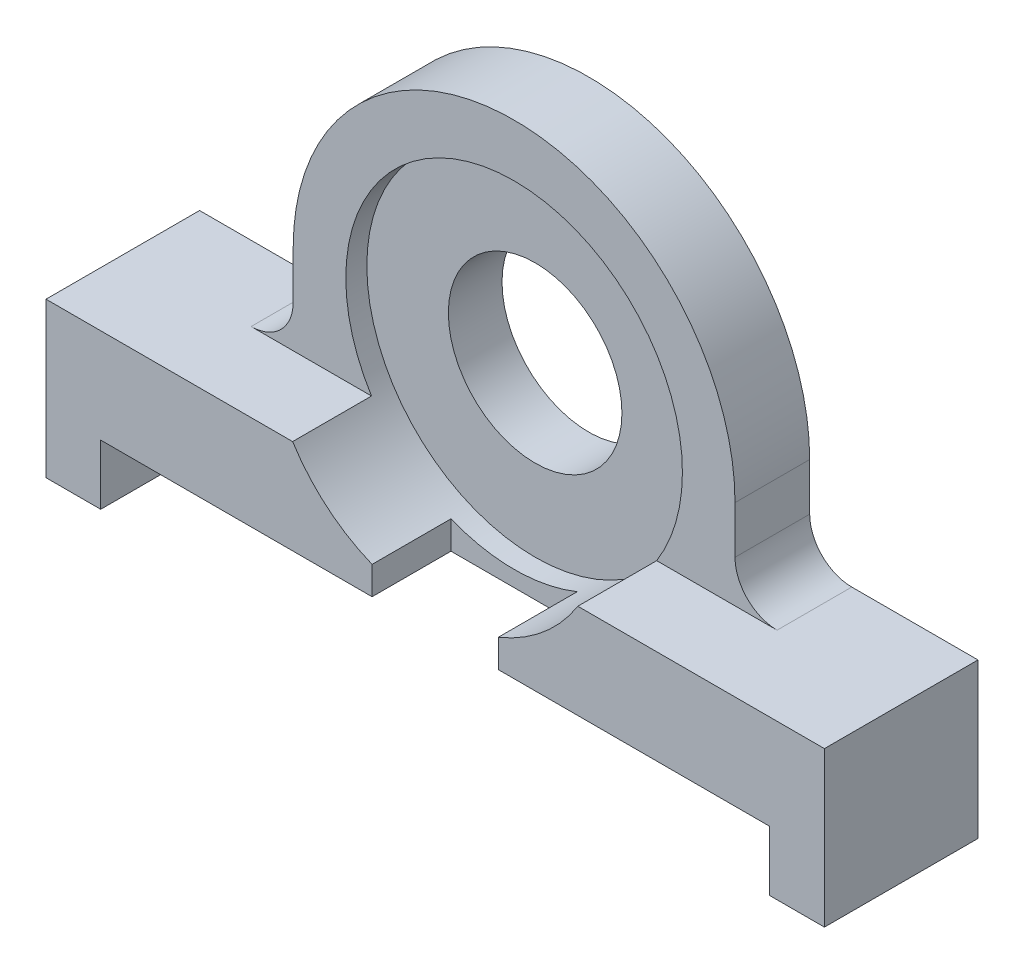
from build123d import *

# Parameters (mm, degrees)
SKETCH2_R           = 16
BOSS_EXTRUDE1_DEPTH = 12
SKETCH3_R           = 16
SKETCH3_R_2         = 8.25
BOSS_EXTRUDE2_DEPTH = 2.5
CUT_EXTRUDE4_DEPTH  = 1
CUT_EXTRUDE5_REACH  = 60.683
SKETCH9_W           = 43.6
SKETCH9_H           = 5.7
SKETCH10_R          = 1.25
CUT_EXTRUDE6_DEPTH  = 9
CUT_EXTRUDE7_START  = -7.5
CUT_EXTRUDE7_DEPTH  = 7.5
FILETE1_R           = 2
FILETE2_R           = 4
SKETCH12_W          = 10
SKETCH12_H          = 5.7
CUT_EXTRUDE8_DEPTH  = 7
SKETCH15_W          = 12
SKETCH15_H          = 2.667603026
CUT_EXTRUDE10_DEPTH = 7.5
SKETCH16_R          = 8.25
BOSS_EXTRUDE3_DEPTH = 2.6


with BuildPart() as part:
    # Sketch2 → Boss-Extrude1 (new body)
    with BuildSketch(Plane.XY):
        with BuildLine():
            Line((-21, 0), (21, 0))
            Line((21, 0), (37, 0))
            Line((37, 0), (37, 14.7))
            Line((37, 14.7), (21, 14.7))
            Line((21, 14.7), (21, 23.2))
            ThreePointArc((21, 23.2), (0, 44.2), (-21, 23.2))
            Line((-21, 23.2), (-21, 14.7))
            Line((-21, 14.7), (-37, 14.7))
            Line((-37, 14.7), (-37, 0))
            Line((-37, 0), (-21, 0))
        make_face()
        with Locations((0, 23.2)):
            Circle(SKETCH2_R, mode=Mode.SUBTRACT)
    extrude(amount=BOSS_EXTRUDE1_DEPTH)

    # Sketch3 → Boss-Extrude2 (add)
    with BuildSketch(Plane.XY):
        with Locations((0, 23.2)):
            Circle(SKETCH3_R)
        with Locations((0, 23.2)):
            Circle(SKETCH3_R_2, mode=Mode.SUBTRACT)
    extrude(amount=BOSS_EXTRUDE2_DEPTH)

    # Sketch8 → Cut-Extrude4 (cut)
    with BuildSketch(Plane.XY):
        Polygon((-27, 0), (27, 0), (34.1, 0), (34.1, 7.2), (27, 7.2), (27, 10.55), (-27, 10.55), (-27, 7.2), (-34.1, 7.2), (-34.1, 0), align=None)
    extrude(amount=CUT_EXTRUDE4_DEPTH, mode=Mode.SUBTRACT)

    # Sketch9 → Cut-Extrude5 (cut, up to next)
    with BuildSketch(Plane(origin=(0, 0, 1), x_dir=(-1, 0, 0), z_dir=(0, 0, -1)), mode=Mode.PRIVATE) as cut_extrude5_sk1:
        with Locations((0, 2.85)):
            Rectangle(SKETCH9_W, SKETCH9_H)
    cut_extrude5_tool1 = extrude(cut_extrude5_sk1.sketch, amount=-CUT_EXTRUDE5_REACH, mode=Mode.PRIVATE) & part.part
    add(cut_extrude5_tool1.solids().sort_by_distance((0, 2.85, 1))[0], mode=Mode.SUBTRACT)

    # Sketch10 → Cut-Extrude6 (cut)
    with BuildSketch(Plane.XZ):
        with Locations((-34, 9)):
            Circle(SKETCH10_R)
        with Locations((-34, 3)):
            Circle(SKETCH10_R)
        with Locations(Location((34, 3, 0), (0, 0, 180))):
            Circle(SKETCH10_R)
        with Locations(Location((34, 9, 0), (0, 0, 180))):
            Circle(SKETCH10_R)
    extrude(amount=-CUT_EXTRUDE6_DEPTH, mode=Mode.SUBTRACT)

    # Sketch11 → Cut-Extrude7 (cut)
    with BuildSketch(Plane.XY.offset(12).offset(CUT_EXTRUDE7_START)):
        with BuildLine():
            Line((21, 14.7), (21, 23.2))
            ThreePointArc((21, 23.2), (0, 44.2), (-21, 23.2))
            Line((-21, 23.2), (-21, 14.7))
            Line((-21, 14.7), (21, 14.7))
        make_face()
    extrude(amount=CUT_EXTRUDE7_DEPTH, mode=Mode.SUBTRACT)

    # Filete1
    filete1_edges = [part.edges().sort_by_distance(p)[0] for p in [
        (27, 10.55, 0.5),
        (-27, 10.55, 0.5),
    ]]
    fillet(filete1_edges, radius=FILETE1_R)

    # Filete2
    filete2_edges = [part.edges().sort_by_distance(p)[0] for p in [
        (-21, 14.7, 2.25),
        (21, 14.7, 2.25),
    ]]
    fillet(filete2_edges, radius=FILETE2_R)

    # Sketch12 → Cut-Extrude8 (cut)
    with BuildSketch(Plane.XY.offset(12)):
        with Locations((26.8, 2.85)):
            Rectangle(SKETCH12_W, SKETCH12_H)
        with Locations((-26.8, 2.85)):
            Rectangle(SKETCH12_W, SKETCH12_H)
    extrude(amount=-CUT_EXTRUDE8_DEPTH, mode=Mode.SUBTRACT)

    # Sketch15 → Cut-Extrude10 (cut)
    with BuildSketch(Plane.XY.offset(12)):
        with Locations((0, 7.033801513)):
            Rectangle(SKETCH15_W, SKETCH15_H)
    extrude(amount=-CUT_EXTRUDE10_DEPTH, mode=Mode.SUBTRACT)

    # Sketch16 → Boss-Extrude3 (add)
    with BuildSketch(Plane(origin=(0, 0, 0), x_dir=(-1, 0, 0), z_dir=(0, 0, -1))):
        with BuildLine():
            Line((-37, 14.7), (-25, 14.7))
            ThreePointArc((-25, 14.7), (-22.171572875, 15.871572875), (-21, 18.7))
            Line((-21, 18.7), (-21, 23.2))
            ThreePointArc((-21, 23.2), (0, 44.2), (21, 23.2))
            Line((21, 23.2), (21, 18.7))
            ThreePointArc((21, 18.7), (22.171572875, 15.871572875), (25, 14.7))
            Line((25, 14.7), (37, 14.7))
            Line((37, 14.7), (37, 0))
            Line((37, 0), (34.1, 0))
            Line((34.1, 0), (34.1, 7.2))
            Line((34.1, 7.2), (27, 7.2))
            Line((27, 7.2), (27, 8.55))
            ThreePointArc((27, 8.55), (26.414213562, 9.964213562), (25, 10.55))
            Line((25, 10.55), (-25, 10.55))
            ThreePointArc((-25, 10.55), (-26.414213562, 9.964213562), (-27, 8.55))
            Line((-27, 8.55), (-27, 7.2))
            Line((-27, 7.2), (-34.1, 7.2))
            Line((-34.1, 7.2), (-34.1, 0))
            Line((-34.1, 0), (-37, 0))
            Line((-37, 0), (-37, 14.7))
        make_face()
        with Locations((0, 23.2)):
            Circle(SKETCH16_R, mode=Mode.SUBTRACT)
    extrude(amount=BOSS_EXTRUDE3_DEPTH)


solid = part.part
